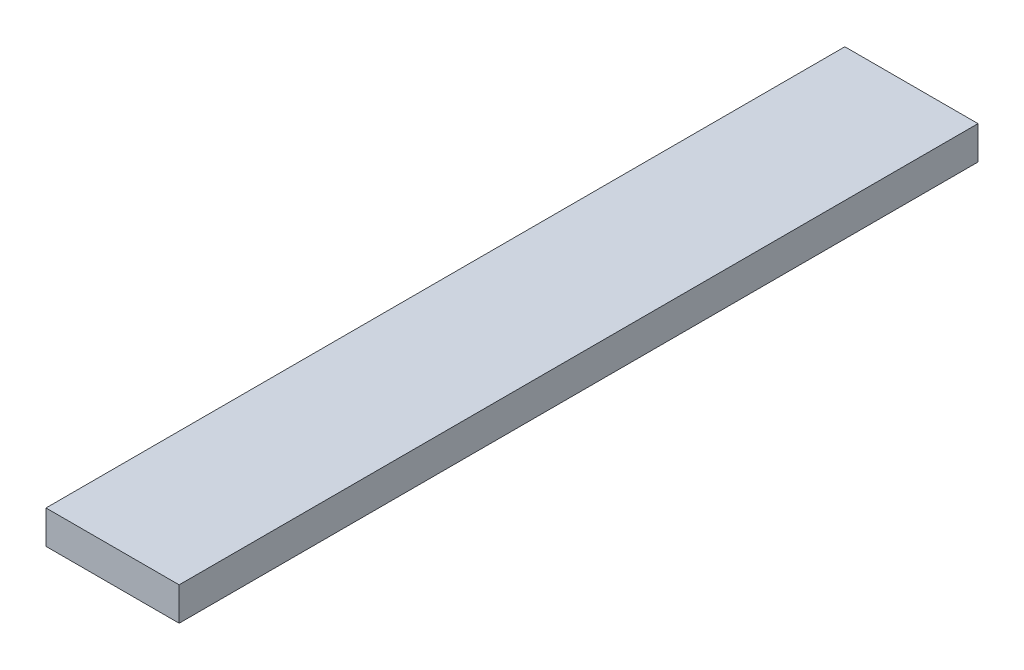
from build123d import *

# Parameters (mm, degrees)
ESQUISSE1_W      = 20
ESQUISSE1_H      = 5
EXTRUSION1_DEPTH = 120


with BuildPart() as part:
    # Esquisse1 → Extrusion1 (new body)
    with BuildSketch(Plane.XY):
        with Locations((10, 2.5)):
            Rectangle(ESQUISSE1_W, ESQUISSE1_H)
    extrude(amount=EXTRUSION1_DEPTH)


solid = part.part
